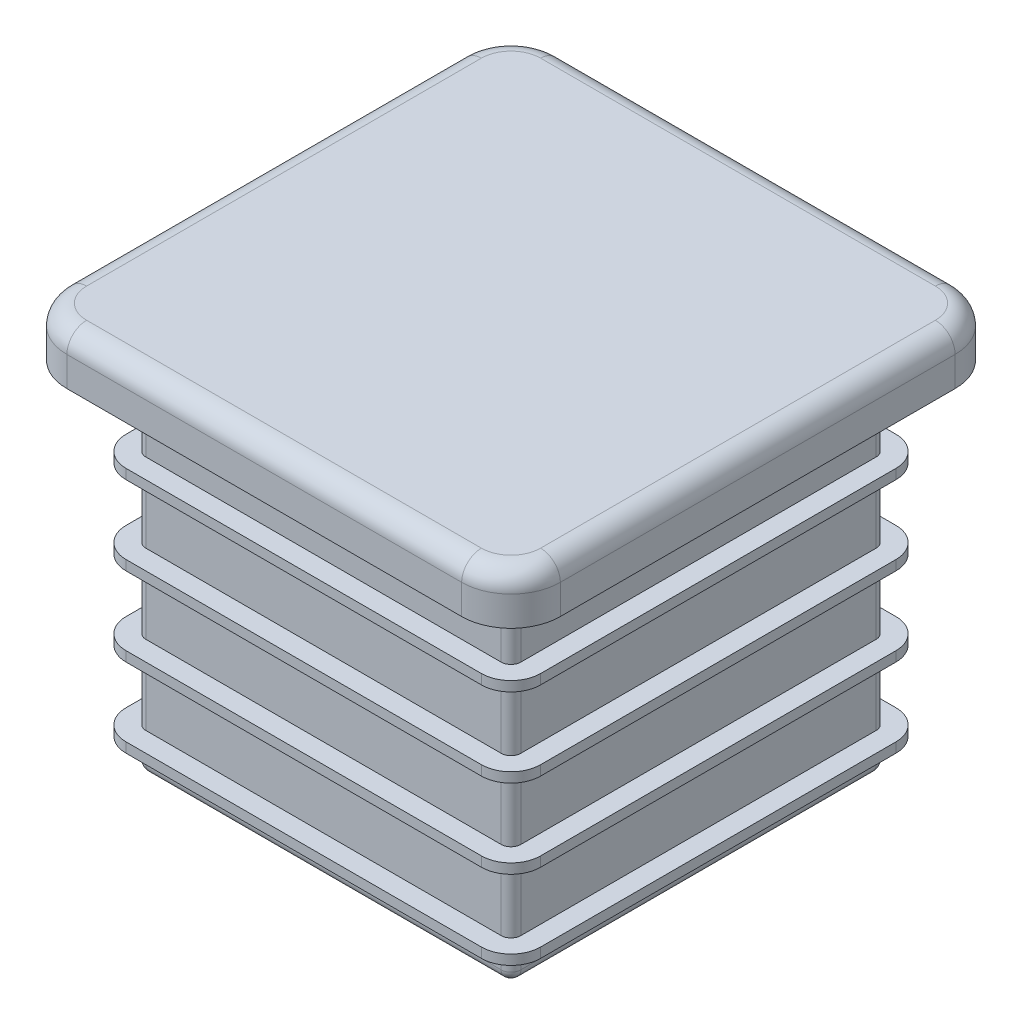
from build123d import *

# Parameters (mm, degrees)
BOSS_EXTRU_1_DEPTH         = 2.5
CONG_1_R                   = 1
ESQUISSE2_W                = 19
ESQUISSE2_H                = 19
ESQUISSE2_W_2              = 16
ESQUISSE2_H_2              = 16
EXTRU_MINCE1_DEPTH         = 18
CONG_2_R                   = 0.5
CONG_3_R                   = 0.5
BOSS_EXTRU_2_START         = 0.5
BOSS_EXTRU_2_DEPTH         = 0.5
R_P_TITION_LIN_AIRE1_COUNT = 4
R_P_TITION_LIN_AIRE1_PITCH = 4


with BuildPart() as part:
    # Esquisse1 → Boss.-Extru.1 (new body)
    with BuildSketch(Plane(origin=(0, 0, 0), x_dir=(1, 0, 0), z_dir=(0, 1, 0))):
        with BuildLine():
            Line((-10, 12.5), (10, 12.5))
            ThreePointArc((10, 12.5), (11.767766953, 11.767766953), (12.5, 10))
            Line((12.5, 10), (12.5, -10))
            ThreePointArc((12.5, -10), (11.767766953, -11.767766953), (10, -12.5))
            Line((10, -12.5), (-10, -12.5))
            ThreePointArc((-10, -12.5), (-11.767766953, -11.767766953), (-12.5, -10))
            Line((-12.5, -10), (-12.5, 10))
            ThreePointArc((-12.5, 10), (-11.767766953, 11.767766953), (-10, 12.5))
        make_face()
    extrude(amount=BOSS_EXTRU_1_DEPTH)

    # Cong_1
    cong_1_edges = [part.edges().sort_by_distance(p)[0] for p in [
        (11.767766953, 2.5, 11.767766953),
        (12.5, 2.5, 0),
        (11.767766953, 2.5, -11.767766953),
        (0, 2.5, -12.5),
        (-11.767766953, 2.5, -11.767766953),
        (-12.5, 2.5, 0),
        (-11.767766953, 2.5, 11.767766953),
        (0, 2.5, 12.5),
    ]]
    fillet(cong_1_edges, radius=CONG_1_R)

    # Esquisse2 → Extru.-Mince1 (add)
    with BuildSketch(Plane.XZ):
        Rectangle(ESQUISSE2_W, ESQUISSE2_H)
        Rectangle(ESQUISSE2_W_2, ESQUISSE2_H_2, mode=Mode.SUBTRACT)
    extrude(amount=EXTRU_MINCE1_DEPTH)

    # Cong_2
    cong_2_edges = [part.edges().sort_by_distance(p)[0] for p in [
        (9.5, -9, -9.5),
        (9.5, -9, 9.5),
        (-9.5, -9, 9.5),
        (-9.5, -9, -9.5),
    ]]
    fillet(cong_2_edges, radius=CONG_2_R)

    # Cong_3
    cong_3_edges = [part.edges().sort_by_distance(p)[0] for p in [
        (-9.5, -18, 0),
        (0, -18, 9.5),
        (9.5, -18, 0),
        (0, -18, -9.5),
        (9.353553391, -18, -9.353553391),
        (9.353553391, -18, 9.353553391),
        (-9.353553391, -18, -9.353553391),
        (-9.353553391, -18, 9.353553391),
    ]]
    fillet(cong_3_edges, radius=CONG_3_R)

    # Esquisse3 → Boss.-Extru.2 (add)
    with BuildSketch(Plane(origin=(0, -4, 0), x_dir=(-1, 0, 0), z_dir=(0, -1, 0)).offset(BOSS_EXTRU_2_START)):
        with BuildLine():
            Line((10.5, -9), (10.5, 9))
            ThreePointArc((10.5, 9), (10.060660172, 10.060660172), (9, 10.5))
            Line((9, 10.5), (-9, 10.5))
            ThreePointArc((-9, 10.5), (-10.060660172, 10.060660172), (-10.5, 9))
            Line((-10.5, 9), (-10.5, -9))
            ThreePointArc((-10.5, -9), (-10.060660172, -10.060660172), (-9, -10.5))
            Line((-9, -10.5), (9, -10.5))
            ThreePointArc((9, -10.5), (10.060660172, -10.060660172), (10.5, -9))
        make_face()
        with BuildLine():
            Line((9.5, -9), (9.5, 9))
            ThreePointArc((9.5, 9), (9.353553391, 9.353553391), (9, 9.5))
            Line((9, 9.5), (-9, 9.5))
            ThreePointArc((-9, 9.5), (-9.353553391, 9.353553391), (-9.5, 9))
            Line((-9.5, 9), (-9.5, -9))
            ThreePointArc((-9.5, -9), (-9.353553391, -9.353553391), (-9, -9.5))
            Line((-9, -9.5), (9, -9.5))
            ThreePointArc((9, -9.5), (9.353553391, -9.353553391), (9.5, -9))
        make_face(mode=Mode.SUBTRACT)
    boss_extru_2 = extrude(amount=-BOSS_EXTRU_2_DEPTH)

    # R_p_tition lin_aire1: Boss.-Extru.2 ×4
    with Locations(*[(0, -i * R_P_TITION_LIN_AIRE1_PITCH, 0) for i in range(1, R_P_TITION_LIN_AIRE1_COUNT)]):
        add(boss_extru_2)


solid = part.part
